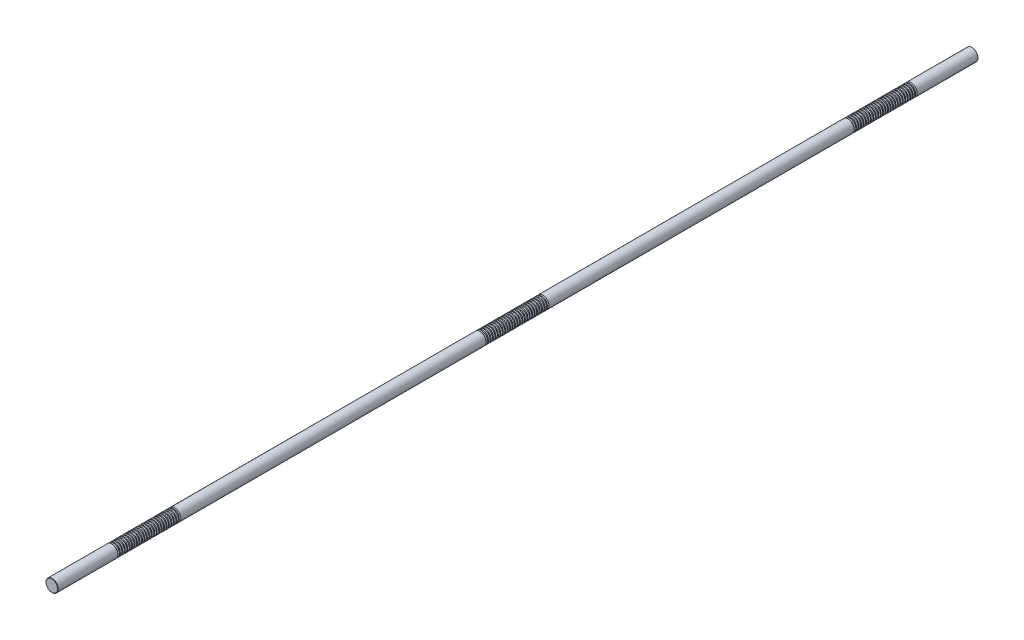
from build123d import *

# Parameters (mm, degrees)
SKETCH1_R           = 10
BOSS_EXTRUDE1_DEPTH = 750
CHAMFER1_SIZE       = 0.5
LPATTERN1_COUNT     = 26
LPATTERN1_PITCH     = 4
LPATTERN2_COUNT     = 3
LPATTERN2_PITCH     = 600


with BuildPart() as part:
    # Sketch1 → Boss-Extrude1 (new, symmetric)
    with BuildSketch(Plane.XY):
        Circle(SKETCH1_R)
    extrude(amount=BOSS_EXTRUDE1_DEPTH, both=True)

    # Chamfer1
    chamfer1_edges = [part.edges().sort_by_distance(p)[0] for p in [
        (-10, 0, -750),
        (-10, 0, 750),
    ]]
    chamfer(chamfer1_edges, length=CHAMFER1_SIZE)

    # Sketch2 → Cut-Revolve1 (revolve, cut)
    with BuildSketch(Plane(origin=(0, 0, 0), x_dir=(0, 0, -1), z_dir=(1, 0, 0)), mode=Mode.PRIVATE) as cut_revolve1_sk:
        Polygon((650.301442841, 10), (647.698557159, 10), (648.301442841, 7.75), (649.698557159, 7.75), align=None)
    cut_revolve1 = revolve(cut_revolve1_sk.sketch.rotate(Axis((0, 0, 750), (0, 0, -1)), 90), axis=Axis((0, 0, 750), (0, 0, -1)), mode=Mode.SUBTRACT)

    # LPattern1: Cut-Revolve1 ×26
    with Locations(*[(0, 0, i * LPATTERN1_PITCH) for i in range(1, LPATTERN1_COUNT)]):
        add(cut_revolve1, mode=Mode.SUBTRACT)

    # LPattern2: Cut-Revolve1 ×3
    with Locations(*[(0, 0, i * LPATTERN2_PITCH) for i in range(1, LPATTERN2_COUNT)]):
        add(cut_revolve1, mode=Mode.SUBTRACT)

    # LPattern2 copy 1 sketch → LPattern2 copy 1 (revolve, cut)
    with BuildSketch(Plane(origin=(0, 0, 604), x_dir=(0, 0, -1), z_dir=(1, 0, 0))):
        Polygon((650.301442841, 10), (647.698557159, 10), (648.301442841, 7.75), (649.698557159, 7.75), align=None)
    revolve(axis=Axis((0, 0, 1354), (0, 0, -1)), mode=Mode.SUBTRACT)

    # LPattern2 copy 2 sketch → LPattern2 copy 2 (revolve, cut)
    with BuildSketch(Plane(origin=(0, 0, 1204), x_dir=(0, 0, -1), z_dir=(1, 0, 0))):
        Polygon((650.301442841, 10), (647.698557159, 10), (648.301442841, 7.75), (649.698557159, 7.75), align=None)
    revolve(axis=Axis((0, 0, 1954), (0, 0, -1)), mode=Mode.SUBTRACT)

    # LPattern2 copy 3 sketch → LPattern2 copy 3 (revolve, cut)
    with BuildSketch(Plane(origin=(0, 0, 608), x_dir=(0, 0, -1), z_dir=(1, 0, 0))):
        Polygon((650.301442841, 10), (647.698557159, 10), (648.301442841, 7.75), (649.698557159, 7.75), align=None)
    revolve(axis=Axis((0, 0, 1358), (0, 0, -1)), mode=Mode.SUBTRACT)

    # LPattern2 copy 4 sketch → LPattern2 copy 4 (revolve, cut)
    with BuildSketch(Plane(origin=(0, 0, 1208), x_dir=(0, 0, -1), z_dir=(1, 0, 0))):
        Polygon((650.301442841, 10), (647.698557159, 10), (648.301442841, 7.75), (649.698557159, 7.75), align=None)
    revolve(axis=Axis((0, 0, 1958), (0, 0, -1)), mode=Mode.SUBTRACT)

    # LPattern2 copy 5 sketch → LPattern2 copy 5 (revolve, cut)
    with BuildSketch(Plane(origin=(0, 0, 612), x_dir=(0, 0, -1), z_dir=(1, 0, 0))):
        Polygon((650.301442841, 10), (647.698557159, 10), (648.301442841, 7.75), (649.698557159, 7.75), align=None)
    revolve(axis=Axis((0, 0, 1362), (0, 0, -1)), mode=Mode.SUBTRACT)

    # LPattern2 copy 6 sketch → LPattern2 copy 6 (revolve, cut)
    with BuildSketch(Plane(origin=(0, 0, 1212), x_dir=(0, 0, -1), z_dir=(1, 0, 0))):
        Polygon((650.301442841, 10), (647.698557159, 10), (648.301442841, 7.75), (649.698557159, 7.75), align=None)
    revolve(axis=Axis((0, 0, 1962), (0, 0, -1)), mode=Mode.SUBTRACT)

    # LPattern2 copy 7 sketch → LPattern2 copy 7 (revolve, cut)
    with BuildSketch(Plane(origin=(0, 0, 616), x_dir=(0, 0, -1), z_dir=(1, 0, 0))):
        Polygon((650.301442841, 10), (647.698557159, 10), (648.301442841, 7.75), (649.698557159, 7.75), align=None)
    revolve(axis=Axis((0, 0, 1366), (0, 0, -1)), mode=Mode.SUBTRACT)

    # LPattern2 copy 8 sketch → LPattern2 copy 8 (revolve, cut)
    with BuildSketch(Plane(origin=(0, 0, 1216), x_dir=(0, 0, -1), z_dir=(1, 0, 0))):
        Polygon((650.301442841, 10), (647.698557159, 10), (648.301442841, 7.75), (649.698557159, 7.75), align=None)
    revolve(axis=Axis((0, 0, 1966), (0, 0, -1)), mode=Mode.SUBTRACT)

    # LPattern2 copy 9 sketch → LPattern2 copy 9 (revolve, cut)
    with BuildSketch(Plane(origin=(0, 0, 620), x_dir=(0, 0, -1), z_dir=(1, 0, 0))):
        Polygon((650.301442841, 10), (647.698557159, 10), (648.301442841, 7.75), (649.698557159, 7.75), align=None)
    revolve(axis=Axis((0, 0, 1370), (0, 0, -1)), mode=Mode.SUBTRACT)

    # LPattern2 copy 10 sketch → LPattern2 copy 10 (revolve, cut)
    with BuildSketch(Plane(origin=(0, 0, 1220), x_dir=(0, 0, -1), z_dir=(1, 0, 0))):
        Polygon((650.301442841, 10), (647.698557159, 10), (648.301442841, 7.75), (649.698557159, 7.75), align=None)
    revolve(axis=Axis((0, 0, 1970), (0, 0, -1)), mode=Mode.SUBTRACT)

    # LPattern2 copy 11 sketch → LPattern2 copy 11 (revolve, cut)
    with BuildSketch(Plane(origin=(0, 0, 624), x_dir=(0, 0, -1), z_dir=(1, 0, 0))):
        Polygon((650.301442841, 10), (647.698557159, 10), (648.301442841, 7.75), (649.698557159, 7.75), align=None)
    revolve(axis=Axis((0, 0, 1374), (0, 0, -1)), mode=Mode.SUBTRACT)

    # LPattern2 copy 12 sketch → LPattern2 copy 12 (revolve, cut)
    with BuildSketch(Plane(origin=(0, 0, 1224), x_dir=(0, 0, -1), z_dir=(1, 0, 0))):
        Polygon((650.301442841, 10), (647.698557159, 10), (648.301442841, 7.75), (649.698557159, 7.75), align=None)
    revolve(axis=Axis((0, 0, 1974), (0, 0, -1)), mode=Mode.SUBTRACT)

    # LPattern2 copy 13 sketch → LPattern2 copy 13 (revolve, cut)
    with BuildSketch(Plane(origin=(0, 0, 628), x_dir=(0, 0, -1), z_dir=(1, 0, 0))):
        Polygon((650.301442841, 10), (647.698557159, 10), (648.301442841, 7.75), (649.698557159, 7.75), align=None)
    revolve(axis=Axis((0, 0, 1378), (0, 0, -1)), mode=Mode.SUBTRACT)

    # LPattern2 copy 14 sketch → LPattern2 copy 14 (revolve, cut)
    with BuildSketch(Plane(origin=(0, 0, 1228), x_dir=(0, 0, -1), z_dir=(1, 0, 0))):
        Polygon((650.301442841, 10), (647.698557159, 10), (648.301442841, 7.75), (649.698557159, 7.75), align=None)
    revolve(axis=Axis((0, 0, 1978), (0, 0, -1)), mode=Mode.SUBTRACT)

    # LPattern2 copy 15 sketch → LPattern2 copy 15 (revolve, cut)
    with BuildSketch(Plane(origin=(0, 0, 632), x_dir=(0, 0, -1), z_dir=(1, 0, 0))):
        Polygon((650.301442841, 10), (647.698557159, 10), (648.301442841, 7.75), (649.698557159, 7.75), align=None)
    revolve(axis=Axis((0, 0, 1382), (0, 0, -1)), mode=Mode.SUBTRACT)

    # LPattern2 copy 16 sketch → LPattern2 copy 16 (revolve, cut)
    with BuildSketch(Plane(origin=(0, 0, 1232), x_dir=(0, 0, -1), z_dir=(1, 0, 0))):
        Polygon((650.301442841, 10), (647.698557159, 10), (648.301442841, 7.75), (649.698557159, 7.75), align=None)
    revolve(axis=Axis((0, 0, 1982), (0, 0, -1)), mode=Mode.SUBTRACT)

    # LPattern2 copy 17 sketch → LPattern2 copy 17 (revolve, cut)
    with BuildSketch(Plane(origin=(0, 0, 636), x_dir=(0, 0, -1), z_dir=(1, 0, 0))):
        Polygon((650.301442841, 10), (647.698557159, 10), (648.301442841, 7.75), (649.698557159, 7.75), align=None)
    revolve(axis=Axis((0, 0, 1386), (0, 0, -1)), mode=Mode.SUBTRACT)

    # LPattern2 copy 18 sketch → LPattern2 copy 18 (revolve, cut)
    with BuildSketch(Plane(origin=(0, 0, 1236), x_dir=(0, 0, -1), z_dir=(1, 0, 0))):
        Polygon((650.301442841, 10), (647.698557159, 10), (648.301442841, 7.75), (649.698557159, 7.75), align=None)
    revolve(axis=Axis((0, 0, 1986), (0, 0, -1)), mode=Mode.SUBTRACT)

    # LPattern2 copy 19 sketch → LPattern2 copy 19 (revolve, cut)
    with BuildSketch(Plane(origin=(0, 0, 640), x_dir=(0, 0, -1), z_dir=(1, 0, 0))):
        Polygon((650.301442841, 10), (647.698557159, 10), (648.301442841, 7.75), (649.698557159, 7.75), align=None)
    revolve(axis=Axis((0, 0, 1390), (0, 0, -1)), mode=Mode.SUBTRACT)

    # LPattern2 copy 20 sketch → LPattern2 copy 20 (revolve, cut)
    with BuildSketch(Plane(origin=(0, 0, 1240), x_dir=(0, 0, -1), z_dir=(1, 0, 0))):
        Polygon((650.301442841, 10), (647.698557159, 10), (648.301442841, 7.75), (649.698557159, 7.75), align=None)
    revolve(axis=Axis((0, 0, 1990), (0, 0, -1)), mode=Mode.SUBTRACT)

    # LPattern2 copy 21 sketch → LPattern2 copy 21 (revolve, cut)
    with BuildSketch(Plane(origin=(0, 0, 644), x_dir=(0, 0, -1), z_dir=(1, 0, 0))):
        Polygon((650.301442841, 10), (647.698557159, 10), (648.301442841, 7.75), (649.698557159, 7.75), align=None)
    revolve(axis=Axis((0, 0, 1394), (0, 0, -1)), mode=Mode.SUBTRACT)

    # LPattern2 copy 22 sketch → LPattern2 copy 22 (revolve, cut)
    with BuildSketch(Plane(origin=(0, 0, 1244), x_dir=(0, 0, -1), z_dir=(1, 0, 0))):
        Polygon((650.301442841, 10), (647.698557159, 10), (648.301442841, 7.75), (649.698557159, 7.75), align=None)
    revolve(axis=Axis((0, 0, 1994), (0, 0, -1)), mode=Mode.SUBTRACT)

    # LPattern2 copy 23 sketch → LPattern2 copy 23 (revolve, cut)
    with BuildSketch(Plane(origin=(0, 0, 648), x_dir=(0, 0, -1), z_dir=(1, 0, 0))):
        Polygon((650.301442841, 10), (647.698557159, 10), (648.301442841, 7.75), (649.698557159, 7.75), align=None)
    revolve(axis=Axis((0, 0, 1398), (0, 0, -1)), mode=Mode.SUBTRACT)

    # LPattern2 copy 24 sketch → LPattern2 copy 24 (revolve, cut)
    with BuildSketch(Plane(origin=(0, 0, 1248), x_dir=(0, 0, -1), z_dir=(1, 0, 0))):
        Polygon((650.301442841, 10), (647.698557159, 10), (648.301442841, 7.75), (649.698557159, 7.75), align=None)
    revolve(axis=Axis((0, 0, 1998), (0, 0, -1)), mode=Mode.SUBTRACT)

    # LPattern2 copy 25 sketch → LPattern2 copy 25 (revolve, cut)
    with BuildSketch(Plane(origin=(0, 0, 652), x_dir=(0, 0, -1), z_dir=(1, 0, 0))):
        Polygon((650.301442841, 10), (647.698557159, 10), (648.301442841, 7.75), (649.698557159, 7.75), align=None)
    revolve(axis=Axis((0, 0, 1402), (0, 0, -1)), mode=Mode.SUBTRACT)

    # LPattern2 copy 26 sketch → LPattern2 copy 26 (revolve, cut)
    with BuildSketch(Plane(origin=(0, 0, 1252), x_dir=(0, 0, -1), z_dir=(1, 0, 0))):
        Polygon((650.301442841, 10), (647.698557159, 10), (648.301442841, 7.75), (649.698557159, 7.75), align=None)
    revolve(axis=Axis((0, 0, 2002), (0, 0, -1)), mode=Mode.SUBTRACT)

    # LPattern2 copy 27 sketch → LPattern2 copy 27 (revolve, cut)
    with BuildSketch(Plane(origin=(0, 0, 656), x_dir=(0, 0, -1), z_dir=(1, 0, 0))):
        Polygon((650.301442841, 10), (647.698557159, 10), (648.301442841, 7.75), (649.698557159, 7.75), align=None)
    revolve(axis=Axis((0, 0, 1406), (0, 0, -1)), mode=Mode.SUBTRACT)

    # LPattern2 copy 28 sketch → LPattern2 copy 28 (revolve, cut)
    with BuildSketch(Plane(origin=(0, 0, 1256), x_dir=(0, 0, -1), z_dir=(1, 0, 0))):
        Polygon((650.301442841, 10), (647.698557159, 10), (648.301442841, 7.75), (649.698557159, 7.75), align=None)
    revolve(axis=Axis((0, 0, 2006), (0, 0, -1)), mode=Mode.SUBTRACT)

    # LPattern2 copy 29 sketch → LPattern2 copy 29 (revolve, cut)
    with BuildSketch(Plane(origin=(0, 0, 660), x_dir=(0, 0, -1), z_dir=(1, 0, 0))):
        Polygon((650.301442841, 10), (647.698557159, 10), (648.301442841, 7.75), (649.698557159, 7.75), align=None)
    revolve(axis=Axis((0, 0, 1410), (0, 0, -1)), mode=Mode.SUBTRACT)

    # LPattern2 copy 30 sketch → LPattern2 copy 30 (revolve, cut)
    with BuildSketch(Plane(origin=(0, 0, 1260), x_dir=(0, 0, -1), z_dir=(1, 0, 0))):
        Polygon((650.301442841, 10), (647.698557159, 10), (648.301442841, 7.75), (649.698557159, 7.75), align=None)
    revolve(axis=Axis((0, 0, 2010), (0, 0, -1)), mode=Mode.SUBTRACT)

    # LPattern2 copy 31 sketch → LPattern2 copy 31 (revolve, cut)
    with BuildSketch(Plane(origin=(0, 0, 664), x_dir=(0, 0, -1), z_dir=(1, 0, 0))):
        Polygon((650.301442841, 10), (647.698557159, 10), (648.301442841, 7.75), (649.698557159, 7.75), align=None)
    revolve(axis=Axis((0, 0, 1414), (0, 0, -1)), mode=Mode.SUBTRACT)

    # LPattern2 copy 32 sketch → LPattern2 copy 32 (revolve, cut)
    with BuildSketch(Plane(origin=(0, 0, 1264), x_dir=(0, 0, -1), z_dir=(1, 0, 0))):
        Polygon((650.301442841, 10), (647.698557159, 10), (648.301442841, 7.75), (649.698557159, 7.75), align=None)
    revolve(axis=Axis((0, 0, 2014), (0, 0, -1)), mode=Mode.SUBTRACT)

    # LPattern2 copy 33 sketch → LPattern2 copy 33 (revolve, cut)
    with BuildSketch(Plane(origin=(0, 0, 668), x_dir=(0, 0, -1), z_dir=(1, 0, 0))):
        Polygon((650.301442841, 10), (647.698557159, 10), (648.301442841, 7.75), (649.698557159, 7.75), align=None)
    revolve(axis=Axis((0, 0, 1418), (0, 0, -1)), mode=Mode.SUBTRACT)

    # LPattern2 copy 34 sketch → LPattern2 copy 34 (revolve, cut)
    with BuildSketch(Plane(origin=(0, 0, 1268), x_dir=(0, 0, -1), z_dir=(1, 0, 0))):
        Polygon((650.301442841, 10), (647.698557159, 10), (648.301442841, 7.75), (649.698557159, 7.75), align=None)
    revolve(axis=Axis((0, 0, 2018), (0, 0, -1)), mode=Mode.SUBTRACT)

    # LPattern2 copy 35 sketch → LPattern2 copy 35 (revolve, cut)
    with BuildSketch(Plane(origin=(0, 0, 672), x_dir=(0, 0, -1), z_dir=(1, 0, 0))):
        Polygon((650.301442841, 10), (647.698557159, 10), (648.301442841, 7.75), (649.698557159, 7.75), align=None)
    revolve(axis=Axis((0, 0, 1422), (0, 0, -1)), mode=Mode.SUBTRACT)

    # LPattern2 copy 36 sketch → LPattern2 copy 36 (revolve, cut)
    with BuildSketch(Plane(origin=(0, 0, 1272), x_dir=(0, 0, -1), z_dir=(1, 0, 0))):
        Polygon((650.301442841, 10), (647.698557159, 10), (648.301442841, 7.75), (649.698557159, 7.75), align=None)
    revolve(axis=Axis((0, 0, 2022), (0, 0, -1)), mode=Mode.SUBTRACT)

    # LPattern2 copy 37 sketch → LPattern2 copy 37 (revolve, cut)
    with BuildSketch(Plane(origin=(0, 0, 676), x_dir=(0, 0, -1), z_dir=(1, 0, 0))):
        Polygon((650.301442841, 10), (647.698557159, 10), (648.301442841, 7.75), (649.698557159, 7.75), align=None)
    revolve(axis=Axis((0, 0, 1426), (0, 0, -1)), mode=Mode.SUBTRACT)

    # LPattern2 copy 38 sketch → LPattern2 copy 38 (revolve, cut)
    with BuildSketch(Plane(origin=(0, 0, 1276), x_dir=(0, 0, -1), z_dir=(1, 0, 0))):
        Polygon((650.301442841, 10), (647.698557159, 10), (648.301442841, 7.75), (649.698557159, 7.75), align=None)
    revolve(axis=Axis((0, 0, 2026), (0, 0, -1)), mode=Mode.SUBTRACT)

    # LPattern2 copy 39 sketch → LPattern2 copy 39 (revolve, cut)
    with BuildSketch(Plane(origin=(0, 0, 680), x_dir=(0, 0, -1), z_dir=(1, 0, 0))):
        Polygon((650.301442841, 10), (647.698557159, 10), (648.301442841, 7.75), (649.698557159, 7.75), align=None)
    revolve(axis=Axis((0, 0, 1430), (0, 0, -1)), mode=Mode.SUBTRACT)

    # LPattern2 copy 40 sketch → LPattern2 copy 40 (revolve, cut)
    with BuildSketch(Plane(origin=(0, 0, 1280), x_dir=(0, 0, -1), z_dir=(1, 0, 0))):
        Polygon((650.301442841, 10), (647.698557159, 10), (648.301442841, 7.75), (649.698557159, 7.75), align=None)
    revolve(axis=Axis((0, 0, 2030), (0, 0, -1)), mode=Mode.SUBTRACT)

    # LPattern2 copy 41 sketch → LPattern2 copy 41 (revolve, cut)
    with BuildSketch(Plane(origin=(0, 0, 684), x_dir=(0, 0, -1), z_dir=(1, 0, 0))):
        Polygon((650.301442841, 10), (647.698557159, 10), (648.301442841, 7.75), (649.698557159, 7.75), align=None)
    revolve(axis=Axis((0, 0, 1434), (0, 0, -1)), mode=Mode.SUBTRACT)

    # LPattern2 copy 42 sketch → LPattern2 copy 42 (revolve, cut)
    with BuildSketch(Plane(origin=(0, 0, 1284), x_dir=(0, 0, -1), z_dir=(1, 0, 0))):
        Polygon((650.301442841, 10), (647.698557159, 10), (648.301442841, 7.75), (649.698557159, 7.75), align=None)
    revolve(axis=Axis((0, 0, 2034), (0, 0, -1)), mode=Mode.SUBTRACT)

    # LPattern2 copy 43 sketch → LPattern2 copy 43 (revolve, cut)
    with BuildSketch(Plane(origin=(0, 0, 688), x_dir=(0, 0, -1), z_dir=(1, 0, 0))):
        Polygon((650.301442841, 10), (647.698557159, 10), (648.301442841, 7.75), (649.698557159, 7.75), align=None)
    revolve(axis=Axis((0, 0, 1438), (0, 0, -1)), mode=Mode.SUBTRACT)

    # LPattern2 copy 44 sketch → LPattern2 copy 44 (revolve, cut)
    with BuildSketch(Plane(origin=(0, 0, 1288), x_dir=(0, 0, -1), z_dir=(1, 0, 0))):
        Polygon((650.301442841, 10), (647.698557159, 10), (648.301442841, 7.75), (649.698557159, 7.75), align=None)
    revolve(axis=Axis((0, 0, 2038), (0, 0, -1)), mode=Mode.SUBTRACT)

    # LPattern2 copy 45 sketch → LPattern2 copy 45 (revolve, cut)
    with BuildSketch(Plane(origin=(0, 0, 692), x_dir=(0, 0, -1), z_dir=(1, 0, 0))):
        Polygon((650.301442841, 10), (647.698557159, 10), (648.301442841, 7.75), (649.698557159, 7.75), align=None)
    revolve(axis=Axis((0, 0, 1442), (0, 0, -1)), mode=Mode.SUBTRACT)

    # LPattern2 copy 46 sketch → LPattern2 copy 46 (revolve, cut)
    with BuildSketch(Plane(origin=(0, 0, 1292), x_dir=(0, 0, -1), z_dir=(1, 0, 0))):
        Polygon((650.301442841, 10), (647.698557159, 10), (648.301442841, 7.75), (649.698557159, 7.75), align=None)
    revolve(axis=Axis((0, 0, 2042), (0, 0, -1)), mode=Mode.SUBTRACT)

    # LPattern2 copy 47 sketch → LPattern2 copy 47 (revolve, cut)
    with BuildSketch(Plane(origin=(0, 0, 696), x_dir=(0, 0, -1), z_dir=(1, 0, 0))):
        Polygon((650.301442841, 10), (647.698557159, 10), (648.301442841, 7.75), (649.698557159, 7.75), align=None)
    revolve(axis=Axis((0, 0, 1446), (0, 0, -1)), mode=Mode.SUBTRACT)

    # LPattern2 copy 48 sketch → LPattern2 copy 48 (revolve, cut)
    with BuildSketch(Plane(origin=(0, 0, 1296), x_dir=(0, 0, -1), z_dir=(1, 0, 0))):
        Polygon((650.301442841, 10), (647.698557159, 10), (648.301442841, 7.75), (649.698557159, 7.75), align=None)
    revolve(axis=Axis((0, 0, 2046), (0, 0, -1)), mode=Mode.SUBTRACT)

    # LPattern2 copy 49 sketch → LPattern2 copy 49 (revolve, cut)
    with BuildSketch(Plane(origin=(0, 0, 700), x_dir=(0, 0, -1), z_dir=(1, 0, 0))):
        Polygon((650.301442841, 10), (647.698557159, 10), (648.301442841, 7.75), (649.698557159, 7.75), align=None)
    revolve(axis=Axis((0, 0, 1450), (0, 0, -1)), mode=Mode.SUBTRACT)

    # LPattern2 copy 50 sketch → LPattern2 copy 50 (revolve, cut)
    with BuildSketch(Plane(origin=(0, 0, 1300), x_dir=(0, 0, -1), z_dir=(1, 0, 0))):
        Polygon((650.301442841, 10), (647.698557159, 10), (648.301442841, 7.75), (649.698557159, 7.75), align=None)
    revolve(axis=Axis((0, 0, 2050), (0, 0, -1)), mode=Mode.SUBTRACT)


solid = part.part
